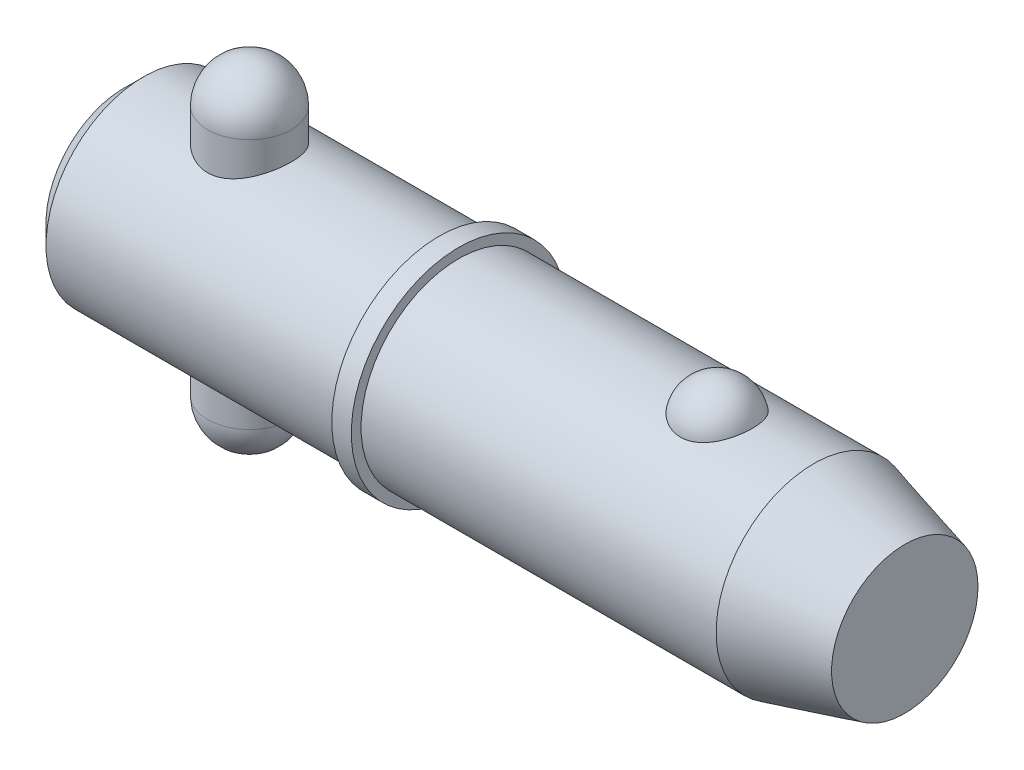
ISO-10303-21;
HEADER;
FILE_DESCRIPTION(('STEP AP214'),'2;1');
FILE_NAME('part.step','',(''),(''),'','','');
FILE_SCHEMA(('AUTOMOTIVE_DESIGN { 1 0 10303 214 1 1 1 1 }'));
ENDSEC;
DATA;
#1=APPLICATION_CONTEXT('core data for automotive mechanical design processes');
#2=APPLICATION_PROTOCOL_DEFINITION('international standard','automotive_design',2000,#1);
#3=PRODUCT_CONTEXT('',#1,'mechanical');
#4=PRODUCT('Part','Part','',(#3));
#5=PRODUCT_RELATED_PRODUCT_CATEGORY('part','',(#4));
#6=PRODUCT_DEFINITION_FORMATION('','',#4);
#7=PRODUCT_DEFINITION_CONTEXT('part definition',#1,'design');
#8=PRODUCT_DEFINITION('design','',#6,#7);
#9=PRODUCT_DEFINITION_SHAPE('','',#8);
#10=(LENGTH_UNIT() NAMED_UNIT(*) SI_UNIT(.MILLI.,.METRE.));
#11=(NAMED_UNIT(*) PLANE_ANGLE_UNIT() SI_UNIT($,.RADIAN.));
#12=(NAMED_UNIT(*) SI_UNIT($,.STERADIAN.) SOLID_ANGLE_UNIT());
#13=UNCERTAINTY_MEASURE_WITH_UNIT(LENGTH_MEASURE(1.E-05),#10,'distance_accuracy_value','');
#14=(GEOMETRIC_REPRESENTATION_CONTEXT(3) GLOBAL_UNCERTAINTY_ASSIGNED_CONTEXT((#13)) GLOBAL_UNIT_ASSIGNED_CONTEXT((#10,
#11,#12)) REPRESENTATION_CONTEXT('',''));
#15=CARTESIAN_POINT('',(0.,0.,0.));
#16=DIRECTION('',(0.,0.,1.));
#17=DIRECTION('',(1.,0.,0.));
#18=AXIS2_PLACEMENT_3D('',#15,#16,#17);
#19=CARTESIAN_POINT('',(14.28,19.05,0.));
#20=DIRECTION('',(0.,-1.,0.));
#21=DIRECTION('',(0.,0.,-1.));
#22=AXIS2_PLACEMENT_3D('',#19,#20,#21);
#23=CYLINDRICAL_SURFACE('',#22,4.76);
#24=CARTESIAN_POINT('',(14.28,-14.29,0.));
#25=DIRECTION('',(0.,-1.,0.));
#26=DIRECTION('',(0.,0.,-1.));
#27=AXIS2_PLACEMENT_3D('',#24,#25,#26);
#28=CIRCLE('',#27,4.76);
#29=CARTESIAN_POINT('',(14.28,-14.29,-4.76));
#30=VERTEX_POINT('',#29);
#31=EDGE_CURVE('P0_E10',#30,#30,#28,.F.);
#32=CARTESIAN_POINT('',(14.28,14.29,0.));
#33=DIRECTION('',(0.,-1.,0.));
#34=DIRECTION('',(0.,0.,-1.));
#35=AXIS2_PLACEMENT_3D('',#32,#33,#34);
#36=CIRCLE('',#35,4.76);
#37=CARTESIAN_POINT('',(14.28,14.29,-4.76));
#38=VERTEX_POINT('',#37);
#39=EDGE_CURVE('P0_E21',#38,#38,#36,.T.);
#40=CARTESIAN_POINT('',(14.28,-14.29,-4.76));
#41=CARTESIAN_POINT('',(14.28,-13.9922916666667,-4.76));
#42=CARTESIAN_POINT('',(14.28,-13.6945833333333,-4.76));
#43=CARTESIAN_POINT('',(14.28,-13.0991666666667,-4.76));
#44=CARTESIAN_POINT('',(14.28,-12.8014583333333,-4.76));
#45=CARTESIAN_POINT('',(14.28,-12.2060416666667,-4.76));
#46=CARTESIAN_POINT('',(14.28,-11.9083333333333,-4.76));
#47=CARTESIAN_POINT('',(14.28,-11.3129166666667,-4.76));
#48=CARTESIAN_POINT('',(14.28,-11.0152083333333,-4.76));
#49=CARTESIAN_POINT('',(14.28,-10.4197916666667,-4.76));
#50=CARTESIAN_POINT('',(14.28,-10.1220833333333,-4.76));
#51=CARTESIAN_POINT('',(14.28,-9.52666666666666,-4.76));
#52=CARTESIAN_POINT('',(14.28,-9.22895833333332,-4.76));
#53=CARTESIAN_POINT('',(14.28,-8.63354166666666,-4.76));
#54=CARTESIAN_POINT('',(14.28,-8.33583333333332,-4.76));
#55=CARTESIAN_POINT('',(14.28,-7.74041666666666,-4.76));
#56=CARTESIAN_POINT('',(14.28,-7.44270833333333,-4.76));
#57=CARTESIAN_POINT('',(14.28,-6.84729166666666,-4.76));
#58=CARTESIAN_POINT('',(14.28,-6.54958333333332,-4.76));
#59=CARTESIAN_POINT('',(14.28,-5.95416666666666,-4.76));
#60=CARTESIAN_POINT('',(14.28,-5.65645833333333,-4.76));
#61=CARTESIAN_POINT('',(14.28,-5.06104166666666,-4.76));
#62=CARTESIAN_POINT('',(14.28,-4.76333333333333,-4.76));
#63=CARTESIAN_POINT('',(14.28,-4.16791666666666,-4.76));
#64=CARTESIAN_POINT('',(14.28,-3.87020833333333,-4.76));
#65=CARTESIAN_POINT('',(14.28,-3.27479166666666,-4.76));
#66=CARTESIAN_POINT('',(14.28,-2.97708333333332,-4.76));
#67=CARTESIAN_POINT('',(14.28,-2.38166666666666,-4.76));
#68=CARTESIAN_POINT('',(14.28,-2.08395833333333,-4.76));
#69=CARTESIAN_POINT('',(14.28,-1.48854166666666,-4.76));
#70=CARTESIAN_POINT('',(14.28,-1.19083333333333,-4.76));
#71=CARTESIAN_POINT('',(14.28,-0.595416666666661,-4.76));
#72=CARTESIAN_POINT('',(14.28,-0.297708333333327,-4.76));
#73=CARTESIAN_POINT('',(14.28,0.297708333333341,-4.76));
#74=CARTESIAN_POINT('',(14.28,0.595416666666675,-4.76));
#75=CARTESIAN_POINT('',(14.28,1.19083333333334,-4.76));
#76=CARTESIAN_POINT('',(14.28,1.48854166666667,-4.76));
#77=CARTESIAN_POINT('',(14.28,2.08395833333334,-4.76));
#78=CARTESIAN_POINT('',(14.28,2.38166666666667,-4.76));
#79=CARTESIAN_POINT('',(14.28,2.97708333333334,-4.76));
#80=CARTESIAN_POINT('',(14.28,3.27479166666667,-4.76));
#81=CARTESIAN_POINT('',(14.28,3.87020833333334,-4.76));
#82=CARTESIAN_POINT('',(14.28,4.16791666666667,-4.76));
#83=CARTESIAN_POINT('',(14.28,4.76333333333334,-4.76));
#84=CARTESIAN_POINT('',(14.28,5.06104166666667,-4.76));
#85=CARTESIAN_POINT('',(14.28,5.65645833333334,-4.76));
#86=CARTESIAN_POINT('',(14.28,5.95416666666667,-4.76));
#87=CARTESIAN_POINT('',(14.28,6.54958333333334,-4.76));
#88=CARTESIAN_POINT('',(14.28,6.84729166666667,-4.76));
#89=CARTESIAN_POINT('',(14.28,7.44270833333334,-4.76));
#90=CARTESIAN_POINT('',(14.28,7.74041666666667,-4.76));
#91=CARTESIAN_POINT('',(14.28,8.33583333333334,-4.76));
#92=CARTESIAN_POINT('',(14.28,8.63354166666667,-4.76));
#93=CARTESIAN_POINT('',(14.28,9.22895833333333,-4.76));
#94=CARTESIAN_POINT('',(14.28,9.52666666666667,-4.76));
#95=CARTESIAN_POINT('',(14.28,10.1220833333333,-4.76));
#96=CARTESIAN_POINT('',(14.28,10.4197916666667,-4.76));
#97=CARTESIAN_POINT('',(14.28,11.0152083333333,-4.76));
#98=CARTESIAN_POINT('',(14.28,11.3129166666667,-4.76));
#99=CARTESIAN_POINT('',(14.28,11.9083333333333,-4.76));
#100=CARTESIAN_POINT('',(14.28,12.2060416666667,-4.76));
#101=CARTESIAN_POINT('',(14.28,12.8014583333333,-4.76));
#102=CARTESIAN_POINT('',(14.28,13.0991666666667,-4.76));
#103=CARTESIAN_POINT('',(14.28,13.6945833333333,-4.76));
#104=CARTESIAN_POINT('',(14.28,13.9922916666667,-4.76));
#105=CARTESIAN_POINT('',(14.28,14.29,-4.76));
#106=B_SPLINE_CURVE_WITH_KNOTS('',3,(#40,#41,#42,#43,#44,#45,#46,#47,#48,#49,#50,#51,#52,#53,
#54,#55,#56,#57,#58,#59,#60,#61,#62,#63,#64,#65,#66,#67,#68,#69,#70,#71,#72,#73,#74,#75,#76,#77,
#78,#79,#80,#81,#82,#83,#84,#85,#86,#87,#88,#89,#90,#91,#92,#93,#94,#95,#96,#97,#98,#99,#100,
#101,#102,#103,#104,#105),.UNSPECIFIED.,.F.,.F.,(4,2,2,2,2,2,2,2,2,2,2,2,2,2,2,2,2,2,2,2,2,2,2,
2,2,2,2,2,2,2,2,2,4),(0.,0.893125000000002,1.78625,2.67937499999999,3.5725,4.465625,5.35875,
6.25187499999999,7.145,8.038125,8.93125,9.82437499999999,10.7175,11.610625,12.50375,13.396875,
14.29,15.183125,16.07625,16.969375,17.8625,18.755625,19.64875,20.541875,21.435,22.328125,
23.22125,24.114375,25.0075,25.900625,26.79375,27.686875,28.58),.UNSPECIFIED.);
#107=EDGE_CURVE('P0_BSEAM14',#30,#38,#106,.T.);
#108=ORIENTED_EDGE('',*,*,#31,.T.);
#109=ORIENTED_EDGE('',*,*,#39,.T.);
#110=ORIENTED_EDGE('',*,*,#107,.T.);
#111=ORIENTED_EDGE('',*,*,#107,.F.);
#112=EDGE_LOOP('',(#108,#110,#109,#111));
#113=FACE_BOUND('',#112,.T.);
#114=ADVANCED_FACE('P0_F14',(#113),#23,.T.);
#115=CARTESIAN_POINT('',(14.28,-14.29,0.));
#116=DIRECTION('',(0.,0.,1.));
#117=DIRECTION('',(1.,0.,0.));
#118=AXIS2_PLACEMENT_3D('',#115,#116,#117);
#119=SPHERICAL_SURFACE('',#118,4.76);
#120=CARTESIAN_POINT('',(14.28,-14.29,0.));
#121=DIRECTION('',(0.,-1.,0.));
#122=DIRECTION('',(0.,0.,-1.));
#123=AXIS2_PLACEMENT_3D('',#120,#121,#122);
#124=SPHERICAL_SURFACE('',#123,4.76);
#125=ORIENTED_EDGE('',*,*,#31,.F.);
#126=EDGE_LOOP('',(#125));
#127=FACE_BOUND('',#126,.T.);
#128=ADVANCED_FACE('P0_F29',(#127),#124,.T.);
#129=CARTESIAN_POINT('',(14.28,14.29,0.));
#130=DIRECTION('',(0.,0.,1.));
#131=DIRECTION('',(1.,0.,0.));
#132=AXIS2_PLACEMENT_3D('',#129,#130,#131);
#133=SPHERICAL_SURFACE('',#132,4.76);
#134=CARTESIAN_POINT('',(14.28,14.29,0.));
#135=DIRECTION('',(0.,-1.,0.));
#136=DIRECTION('',(0.,0.,-1.));
#137=AXIS2_PLACEMENT_3D('',#134,#135,#136);
#138=SPHERICAL_SURFACE('',#137,4.76);
#139=ORIENTED_EDGE('',*,*,#39,.F.);
#140=EDGE_LOOP('',(#139));
#141=FACE_BOUND('',#140,.T.);
#142=ADVANCED_FACE('P0_F16',(#141),#138,.T.);
#143=CLOSED_SHELL('',(#114,#128,#142));
#144=MANIFOLD_SOLID_BREP('P0_B1',#143);
#145=CARTESIAN_POINT('',(0.,0.,0.));
#146=DIRECTION('',(1.,0.,0.));
#147=DIRECTION('',(0.,0.,-1.));
#148=AXIS2_PLACEMENT_3D('',#145,#146,#147);
#149=CYLINDRICAL_SURFACE('',#148,11.115);
#150=CARTESIAN_POINT('',(78.529563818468,0.,0.));
#151=DIRECTION('',(1.,0.,0.));
#152=DIRECTION('',(0.,0.,-1.));
#153=AXIS2_PLACEMENT_3D('',#150,#151,#152);
#154=CIRCLE('',#153,11.115);
#155=CARTESIAN_POINT('',(78.529563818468,0.,-11.115));
#156=VERTEX_POINT('',#155);
#157=EDGE_CURVE('P1_E81',#156,#156,#154,.T.);
#158=ORIENTED_EDGE('',*,*,#157,.F.);
#159=EDGE_LOOP('',(#158));
#160=FACE_BOUND('',#159,.T.);
#161=CARTESIAN_POINT('',(38.1,0.,0.));
#162=DIRECTION('',(1.,0.,0.));
#163=DIRECTION('',(0.,0.,-1.));
#164=AXIS2_PLACEMENT_3D('',#161,#162,#163);
#165=CIRCLE('',#164,11.115);
#166=CARTESIAN_POINT('',(38.1,0.,-11.115));
#167=VERTEX_POINT('',#166);
#168=EDGE_CURVE('P1_E85',#167,#167,#165,.T.);
#169=ORIENTED_EDGE('',*,*,#168,.T.);
#170=EDGE_LOOP('',(#169));
#171=FACE_BOUND('',#170,.T.);
#172=CARTESIAN_POINT('',(67.5310680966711,10.3028087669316,4.17077409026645));
#173=CARTESIAN_POINT('',(67.3147756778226,10.3028003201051,4.17078240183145));
#174=CARTESIAN_POINT('',(67.0985488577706,10.3098895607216,4.15340593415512));
#175=CARTESIAN_POINT('',(66.6725408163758,10.3373834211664,4.08449540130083));
#176=CARTESIAN_POINT('',(66.4627577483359,10.3577841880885,4.03297121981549));
#177=CARTESIAN_POINT('',(66.0557825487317,10.4095237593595,3.89746513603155));
#178=CARTESIAN_POINT('',(65.8585726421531,10.4408466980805,3.81353029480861));
#179=CARTESIAN_POINT('',(65.4813382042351,10.5110236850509,3.61560339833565));
#180=CARTESIAN_POINT('',(65.3013171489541,10.5498792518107,3.50160528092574));
#181=CARTESIAN_POINT('',(64.9576842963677,10.6322884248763,3.24292464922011));
#182=CARTESIAN_POINT('',(64.7946861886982,10.6759443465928,3.09746040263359));
#183=CARTESIAN_POINT('',(64.4945911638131,10.7625291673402,2.78171925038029));
#184=CARTESIAN_POINT('',(64.3574990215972,10.8054579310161,2.61143778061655));
#185=CARTESIAN_POINT('',(64.1064084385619,10.8881935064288,2.24226695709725));
#186=CARTESIAN_POINT('',(63.9937105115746,10.9277761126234,2.04244123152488));
#187=CARTESIAN_POINT('',(63.8017771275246,10.997484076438,1.62578254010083));
#188=CARTESIAN_POINT('',(63.722544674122,11.0276085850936,1.40894804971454));
#189=CARTESIAN_POINT('',(63.5983034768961,11.0756732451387,0.961250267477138));
#190=CARTESIAN_POINT('',(63.553760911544,11.0934470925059,0.730239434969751));
#191=CARTESIAN_POINT('',(63.5015695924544,11.1143331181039,0.263439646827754));
#192=CARTESIAN_POINT('',(63.4939200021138,11.1174456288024,0.0276507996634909));
#193=CARTESIAN_POINT('',(63.5156105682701,11.1087161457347,-0.440729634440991));
#194=CARTESIAN_POINT('',(63.5447624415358,11.0969502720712,-0.673331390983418));
#195=CARTESIAN_POINT('',(63.6391432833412,11.0597872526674,-1.12996621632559));
#196=CARTESIAN_POINT('',(63.7043729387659,11.0343898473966,-1.35399912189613));
#197=CARTESIAN_POINT('',(63.8696984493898,10.972515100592,-1.78750286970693));
#198=CARTESIAN_POINT('',(63.9698386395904,10.9360236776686,-1.99695478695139));
#199=CARTESIAN_POINT('',(64.2029408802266,10.8557595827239,-2.3952066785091));
#200=CARTESIAN_POINT('',(64.3359054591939,10.8119863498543,-2.5840050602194));
#201=CARTESIAN_POINT('',(64.632407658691,10.7216733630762,-2.93635726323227));
#202=CARTESIAN_POINT('',(64.7960565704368,10.675123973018,-3.09981510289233));
#203=CARTESIAN_POINT('',(65.1498601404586,10.5846571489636,-3.39592247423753));
#204=CARTESIAN_POINT('',(65.3400123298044,10.5407394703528,-3.52857487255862));
#205=CARTESIAN_POINT('',(65.7375014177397,10.4616690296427,-3.75646057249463));
#206=CARTESIAN_POINT('',(65.9443670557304,10.4263443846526,-3.85245432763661));
#207=CARTESIAN_POINT('',(66.3729541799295,10.3675574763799,-4.00798747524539));
#208=CARTESIAN_POINT('',(66.594670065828,10.3440907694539,-4.0675405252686));
#209=CARTESIAN_POINT('',(67.0346695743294,10.3128282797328,-4.14614314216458));
#210=CARTESIAN_POINT('',(67.2525654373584,10.3043040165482,-4.1670783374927));
#211=CARTESIAN_POINT('',(67.68894951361,10.3016771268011,-4.17357158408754));
#212=CARTESIAN_POINT('',(67.9074376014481,10.3075716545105,-4.15913661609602));
#213=CARTESIAN_POINT('',(68.3317442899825,10.3326686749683,-4.09636961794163));
#214=CARTESIAN_POINT('',(68.5377458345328,10.3514555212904,-4.0490957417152));
#215=CARTESIAN_POINT('',(68.9385764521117,10.399818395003,-3.92320197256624));
#216=CARTESIAN_POINT('',(69.1334046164,10.4293952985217,-3.84457953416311));
#217=CARTESIAN_POINT('',(69.5111917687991,10.4969600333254,-3.65612410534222));
#218=CARTESIAN_POINT('',(69.6937974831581,10.5351178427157,-3.54564545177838));
#219=CARTESIAN_POINT('',(70.0382040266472,10.6154999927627,-3.29718036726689));
#220=CARTESIAN_POINT('',(70.200000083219,10.657725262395,-3.15918764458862));
#221=CARTESIAN_POINT('',(70.5069596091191,10.744212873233,-2.85163580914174));
#222=CARTESIAN_POINT('',(70.6508919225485,10.7884718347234,-2.68084605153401));
#223=CARTESIAN_POINT('',(70.9092371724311,10.872374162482,-2.31721864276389));
#224=CARTESIAN_POINT('',(71.0236448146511,10.9120167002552,-2.12437704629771));
#225=CARTESIAN_POINT('',(71.2238739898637,10.9838919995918,-1.71516999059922));
#226=CARTESIAN_POINT('',(71.3086617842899,11.0158465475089,-1.498248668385));
#227=CARTESIAN_POINT('',(71.4426838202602,11.0673523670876,-1.052285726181));
#228=CARTESIAN_POINT('',(71.4919174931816,11.086903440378,-0.823243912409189));
#229=CARTESIAN_POINT('',(71.5538915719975,11.1116323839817,-0.359087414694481));
#230=CARTESIAN_POINT('',(71.5665662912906,11.1167843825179,-0.123962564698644));
#231=CARTESIAN_POINT('',(71.554973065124,11.1121144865,0.345220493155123));
#232=CARTESIAN_POINT('',(71.5307056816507,11.1022928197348,0.579278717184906));
#233=CARTESIAN_POINT('',(71.4459073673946,11.0687504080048,1.03866534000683));
#234=CARTESIAN_POINT('',(71.3855299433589,11.0450885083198,1.26402641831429));
#235=CARTESIAN_POINT('',(71.2298532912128,10.9863185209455,1.70076772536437));
#236=CARTESIAN_POINT('',(71.134551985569,10.9512097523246,1.91214712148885));
#237=CARTESIAN_POINT('',(70.9103974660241,10.8729733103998,2.31608359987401));
#238=CARTESIAN_POINT('',(70.7813806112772,10.8298068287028,2.50854240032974));
#239=CARTESIAN_POINT('',(70.4927327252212,10.7401896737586,2.86808766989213));
#240=CARTESIAN_POINT('',(70.3331022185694,10.6937390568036,3.03517457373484));
#241=CARTESIAN_POINT('',(69.9875341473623,10.6029321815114,3.33857581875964));
#242=CARTESIAN_POINT('',(69.8017089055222,10.5585680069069,3.47501541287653));
#243=CARTESIAN_POINT('',(69.4078750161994,10.4769321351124,3.71390897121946));
#244=CARTESIAN_POINT('',(69.1998635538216,10.439661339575,3.81635861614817));
#245=CARTESIAN_POINT('',(68.7540666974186,10.3749407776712,3.98910631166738));
#246=CARTESIAN_POINT('',(68.5152342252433,10.3482457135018,4.05700929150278));
#247=CARTESIAN_POINT('',(68.0279254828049,10.312188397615,4.14782844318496));
#248=CARTESIAN_POINT('',(67.7794535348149,10.3028184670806,4.17076454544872));
#249=CARTESIAN_POINT('',(67.5310680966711,10.3028087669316,4.17077409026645));
#250=B_SPLINE_CURVE_WITH_KNOTS('',3,(#172,#173,#174,#175,#176,#177,#178,#179,#180,#181,#182,
#183,#184,#185,#186,#187,#188,#189,#190,#191,#192,#193,#194,#195,#196,#197,#198,#199,#200,#201,
#202,#203,#204,#205,#206,#207,#208,#209,#210,#211,#212,#213,#214,#215,#216,#217,#218,#219,#220,
#221,#222,#223,#224,#225,#226,#227,#228,#229,#230,#231,#232,#233,#234,#235,#236,#237,#238,#239,
#240,#241,#242,#243,#244,#245,#246,#247,#248,#249),.UNSPECIFIED.,.T.,.F.,(4,2,2,2,2,2,2,2,2,2,2,
2,2,2,2,2,2,2,2,2,2,2,2,2,2,2,2,2,2,2,2,2,2,2,2,2,2,2,4),(0.,0.647966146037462,1.29574482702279,
1.94258643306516,2.58955857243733,3.25496465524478,3.92049326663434,4.61566368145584,
5.31089647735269,6.01531821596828,6.71972398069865,7.42054043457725,8.12137023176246,
8.82309331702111,9.52487047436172,10.2292439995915,10.9335519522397,11.6223330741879,
12.3108558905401,12.9647664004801,13.6185478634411,14.2521847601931,14.8858731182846,
15.5334360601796,16.1811472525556,16.8611459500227,17.5412664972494,18.2431855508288,
18.9451158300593,19.6483065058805,20.3514864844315,21.0516982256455,21.7519516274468,
22.4556690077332,23.1593743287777,23.8601491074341,24.5610129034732,25.3054529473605,
26.049562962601),.UNSPECIFIED.);
#251=CARTESIAN_POINT('',(67.5310680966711,10.3028087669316,4.17077409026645));
#252=VERTEX_POINT('',#251);
#253=EDGE_CURVE('P1_E35',#252,#252,#250,.T.);
#254=ORIENTED_EDGE('',*,*,#253,.T.);
#255=EDGE_LOOP('',(#254));
#256=FACE_BOUND('',#255,.T.);
#257=ADVANCED_FACE('P1_F13',(#160,#171,#256),#149,.T.);
#258=CARTESIAN_POINT('',(0.,0.,0.));
#259=DIRECTION('',(-1.,0.,0.));
#260=DIRECTION('',(0.,0.,1.));
#261=AXIS2_PLACEMENT_3D('',#258,#259,#260);
#262=PLANE('',#261);
#263=CARTESIAN_POINT('',(0.,0.,0.));
#264=DIRECTION('',(1.,0.,0.));
#265=DIRECTION('',(0.,0.,-1.));
#266=AXIS2_PLACEMENT_3D('',#263,#264,#265);
#267=CIRCLE('',#266,8.892);
#268=CARTESIAN_POINT('',(0.,0.,-8.892));
#269=VERTEX_POINT('',#268);
#270=EDGE_CURVE('P1_E9',#269,#269,#267,.T.);
#271=ORIENTED_EDGE('',*,*,#270,.F.);
#272=EDGE_LOOP('',(#271));
#273=FACE_BOUND('',#272,.T.);
#274=ADVANCED_FACE('P1_F15',(#273),#262,.T.);
#275=CARTESIAN_POINT('',(2.22299999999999,0.,0.));
#276=DIRECTION('',(1.,0.,0.));
#277=DIRECTION('',(0.,0.,-1.));
#278=AXIS2_PLACEMENT_3D('',#275,#276,#277);
#279=CONICAL_SURFACE('',#278,11.115,0.78539816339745);
#280=ORIENTED_EDGE('',*,*,#270,.T.);
#281=EDGE_LOOP('',(#280));
#282=FACE_BOUND('',#281,.T.);
#283=CARTESIAN_POINT('',(2.22299999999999,0.,0.));
#284=DIRECTION('',(1.,0.,0.));
#285=DIRECTION('',(0.,0.,-1.));
#286=AXIS2_PLACEMENT_3D('',#283,#284,#285);
#287=CIRCLE('',#286,11.115);
#288=CARTESIAN_POINT('',(2.22299999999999,0.,-11.115));
#289=VERTEX_POINT('',#288);
#290=EDGE_CURVE('P1_E26',#289,#289,#287,.T.);
#291=ORIENTED_EDGE('',*,*,#290,.F.);
#292=EDGE_LOOP('',(#291));
#293=FACE_BOUND('',#292,.T.);
#294=ADVANCED_FACE('P1_F77',(#282,#293),#279,.T.);
#295=CARTESIAN_POINT('',(0.,0.,0.));
#296=DIRECTION('',(1.,0.,0.));
#297=DIRECTION('',(0.,0.,-1.));
#298=AXIS2_PLACEMENT_3D('',#295,#296,#297);
#299=CYLINDRICAL_SURFACE('',#298,11.115);
#300=CARTESIAN_POINT('',(14.28,-10.0441836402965,4.76));
#301=CARTESIAN_POINT('',(14.1533731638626,-10.0441846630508,4.75999904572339));
#302=CARTESIAN_POINT('',(14.0267055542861,-10.0465865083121,4.75493985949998));
#303=CARTESIAN_POINT('',(13.774298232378,-10.0561141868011,4.73475585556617));
#304=CARTESIAN_POINT('',(13.6485591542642,-10.0632429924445,4.71962470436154));
#305=CARTESIAN_POINT('',(13.3987500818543,-10.0819979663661,4.67942666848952));
#306=CARTESIAN_POINT('',(13.2746840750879,-10.0936334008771,4.65433930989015));
#307=CARTESIAN_POINT('',(13.0293244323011,-10.1210146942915,4.59449317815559));
#308=CARTESIAN_POINT('',(12.9080319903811,-10.1367622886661,4.55973032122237));
#309=CARTESIAN_POINT('',(12.669614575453,-10.1717810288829,4.48106435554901));
#310=CARTESIAN_POINT('',(12.5524727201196,-10.1910352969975,4.4372048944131));
#311=CARTESIAN_POINT('',(12.3224300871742,-10.2325403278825,4.34063417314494));
#312=CARTESIAN_POINT('',(12.2095309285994,-10.2547922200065,4.28791957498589));
#313=CARTESIAN_POINT('',(11.8782785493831,-10.3250879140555,4.11715127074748));
#314=CARTESIAN_POINT('',(11.6670799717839,-10.3767168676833,3.98637638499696));
#315=CARTESIAN_POINT('',(11.2564039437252,-10.4874309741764,3.68567149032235));
#316=CARTESIAN_POINT('',(11.0583793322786,-10.5467772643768,3.51386978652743));
#317=CARTESIAN_POINT('',(10.6927724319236,-10.6641377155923,3.13969960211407));
#318=CARTESIAN_POINT('',(10.5252022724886,-10.7221513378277,2.93731900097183));
#319=CARTESIAN_POINT('',(10.2965609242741,-10.8050020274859,2.60935726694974));
#320=CARTESIAN_POINT('',(10.2227768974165,-10.8324811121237,2.49310321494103));
#321=CARTESIAN_POINT('',(10.0853380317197,-10.884703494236,2.25418999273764));
#322=CARTESIAN_POINT('',(10.0216789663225,-10.9094479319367,2.13153352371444));
#323=CARTESIAN_POINT('',(9.90506238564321,-10.9554932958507,1.88060370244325));
#324=CARTESIAN_POINT('',(9.85210574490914,-10.9767939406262,1.7523298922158));
#325=CARTESIAN_POINT('',(9.75746464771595,-11.0153112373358,1.49115740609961));
#326=CARTESIAN_POINT('',(9.71577447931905,-11.0325299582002,1.35826111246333));
#327=CARTESIAN_POINT('',(9.64605475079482,-11.0615607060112,1.09614539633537));
#328=CARTESIAN_POINT('',(9.61740732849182,-11.0736151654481,0.96711700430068));
#329=CARTESIAN_POINT('',(9.57092026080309,-11.0932687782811,0.706847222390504));
#330=CARTESIAN_POINT('',(9.55307574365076,-11.1008699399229,0.575606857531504));
#331=CARTESIAN_POINT('',(9.52838640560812,-11.1114054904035,0.31192917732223));
#332=CARTESIAN_POINT('',(9.52153986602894,-11.114340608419,0.179492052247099));
#333=CARTESIAN_POINT('',(9.51892405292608,-11.1154607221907,-0.0855090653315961));
#334=CARTESIAN_POINT('',(9.52315432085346,-11.1136459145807,-0.218073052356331));
#335=CARTESIAN_POINT('',(9.542009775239,-11.1055891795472,-0.473709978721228));
#336=CARTESIAN_POINT('',(9.55594693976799,-11.099640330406,-0.596843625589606));
#337=CARTESIAN_POINT('',(9.59332832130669,-11.0837823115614,-0.841440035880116));
#338=CARTESIAN_POINT('',(9.61677567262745,-11.0738718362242,-0.962902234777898));
#339=CARTESIAN_POINT('',(9.67294089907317,-11.0503378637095,-1.20325684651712));
#340=CARTESIAN_POINT('',(9.70565569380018,-11.0367156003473,-1.32215009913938));
#341=CARTESIAN_POINT('',(9.78005008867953,-11.0060908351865,-1.55666640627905));
#342=CARTESIAN_POINT('',(9.82173311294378,-10.9890870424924,-1.67228819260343));
#343=CARTESIAN_POINT('',(9.96110379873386,-10.9330280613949,-2.01656166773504));
#344=CARTESIAN_POINT('',(10.0722987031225,-10.8892801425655,-2.23915547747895));
#345=CARTESIAN_POINT('',(10.3268588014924,-10.7934745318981,-2.66299199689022));
#346=CARTESIAN_POINT('',(10.4702355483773,-10.7414138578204,-2.86422700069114));
#347=CARTESIAN_POINT('',(10.7973904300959,-10.6296201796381,-3.25557775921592));
#348=CARTESIAN_POINT('',(10.9833705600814,-10.569604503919,-3.443774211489));
#349=CARTESIAN_POINT('',(11.3844486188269,-10.4514707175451,-3.78722133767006));
#350=CARTESIAN_POINT('',(11.5995590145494,-10.3933534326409,-3.94245783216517));
#351=CARTESIAN_POINT('',(11.9444340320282,-10.311516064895,-4.14990014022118));
#352=CARTESIAN_POINT('',(12.0654579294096,-10.2847012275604,-4.21573894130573));
#353=CARTESIAN_POINT('',(12.3132718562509,-10.2342051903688,-4.33688518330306));
#354=CARTESIAN_POINT('',(12.4400593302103,-10.2105226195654,-4.39219723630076));
#355=CARTESIAN_POINT('',(12.6985418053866,-10.1671237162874,-4.49174500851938));
#356=CARTESIAN_POINT('',(12.8302359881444,-10.1474067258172,-4.53598256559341));
#357=CARTESIAN_POINT('',(13.0975061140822,-10.1126841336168,-4.61287629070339));
#358=CARTESIAN_POINT('',(13.233079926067,-10.0976759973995,-4.64553869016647));
#359=CARTESIAN_POINT('',(13.4978553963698,-10.0737863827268,-4.6971059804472));
#360=CARTESIAN_POINT('',(13.6268754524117,-10.0645618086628,-4.716785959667));
#361=CARTESIAN_POINT('',(13.8862990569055,-10.051062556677,-4.74548419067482));
#362=CARTESIAN_POINT('',(14.0167019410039,-10.0467856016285,-4.75450734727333));
#363=CARTESIAN_POINT('',(14.277859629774,-10.0433352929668,-4.76179143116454));
#364=CARTESIAN_POINT('',(14.4086143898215,-10.0441613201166,-4.76005366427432));
#365=CARTESIAN_POINT('',(14.6694025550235,-10.0508838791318,-4.74584231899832));
#366=CARTESIAN_POINT('',(14.7994359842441,-10.0567802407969,-4.73336910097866));
#367=CARTESIAN_POINT('',(15.0487369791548,-10.0728449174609,-4.69907984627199));
#368=CARTESIAN_POINT('',(15.1681238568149,-10.0826872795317,-4.67797462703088));
#369=CARTESIAN_POINT('',(15.4045894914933,-10.1062580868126,-4.62682977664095));
#370=CARTESIAN_POINT('',(15.5216674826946,-10.1199877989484,-4.59678723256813));
#371=CARTESIAN_POINT('',(15.868278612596,-10.1664161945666,-4.49365911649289));
#372=CARTESIAN_POINT('',(16.0933756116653,-10.2043671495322,-4.40754694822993));
#373=CARTESIAN_POINT('',(16.5357981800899,-10.2919879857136,-4.19898201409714));
#374=CARTESIAN_POINT('',(16.7523611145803,-10.3420954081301,-4.07511281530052));
#375=CARTESIAN_POINT('',(17.1627188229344,-10.4477911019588,-3.7959429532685));
#376=CARTESIAN_POINT('',(17.3565033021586,-10.5033818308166,-3.64062816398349));
#377=CARTESIAN_POINT('',(17.7334034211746,-10.6196376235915,-3.28693729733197));
#378=CARTESIAN_POINT('',(17.9141276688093,-10.6803237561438,-3.08599175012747));
#379=CARTESIAN_POINT('',(18.1582189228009,-10.7666348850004,-2.76320365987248));
#380=CARTESIAN_POINT('',(18.2351223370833,-10.7946346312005,-2.65197124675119));
#381=CARTESIAN_POINT('',(18.3793967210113,-10.8483267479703,-2.42297927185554));
#382=CARTESIAN_POINT('',(18.4467718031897,-10.87402011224,-2.30522255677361));
#383=CARTESIAN_POINT('',(18.5717669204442,-10.9225249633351,-2.06324665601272));
#384=CARTESIAN_POINT('',(18.6293326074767,-10.9453202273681,-1.93899615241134));
#385=CARTESIAN_POINT('',(18.73370006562,-10.9872100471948,-1.6855059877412));
#386=CARTESIAN_POINT('',(18.7805065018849,-11.0063062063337,-1.55626851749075));
#387=CARTESIAN_POINT('',(18.8628731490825,-11.0402419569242,-1.29375150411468));
#388=CARTESIAN_POINT('',(18.8984366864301,-11.0550828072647,-1.16047316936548));
#389=CARTESIAN_POINT('',(18.9579183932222,-11.0800638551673,-0.890912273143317));
#390=CARTESIAN_POINT('',(18.9818374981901,-11.0902044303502,-0.75462995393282));
#391=CARTESIAN_POINT('',(19.0164177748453,-11.104911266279,-0.490295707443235));
#392=CARTESIAN_POINT('',(19.027922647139,-11.1098318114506,-0.362373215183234));
#393=CARTESIAN_POINT('',(19.040554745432,-11.1152360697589,-0.105876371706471));
#394=CARTESIAN_POINT('',(19.0416784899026,-11.1157182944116,0.0226981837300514));
#395=CARTESIAN_POINT('',(19.0335275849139,-11.1122291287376,0.27938352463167));
#396=CARTESIAN_POINT('',(19.0242587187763,-11.1082602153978,0.407494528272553));
#397=CARTESIAN_POINT('',(18.9954320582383,-11.0959792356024,0.662388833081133));
#398=CARTESIAN_POINT('',(18.9758704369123,-11.0876655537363,0.789171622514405));
#399=CARTESIAN_POINT('',(18.9276379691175,-11.0673259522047,1.03545890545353));
#400=CARTESIAN_POINT('',(18.8993573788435,-11.0554596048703,1.15505309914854));
#401=CARTESIAN_POINT('',(18.8337694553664,-11.0282166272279,1.39134516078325));
#402=CARTESIAN_POINT('',(18.7964589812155,-11.0128387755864,1.5080420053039));
#403=CARTESIAN_POINT('',(18.671464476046,-10.9619666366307,1.85262797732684));
#404=CARTESIAN_POINT('',(18.5706772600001,-10.9217161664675,2.07521484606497));
#405=CARTESIAN_POINT('',(18.33202463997,-10.8301378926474,2.51061719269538));
#406=CARTESIAN_POINT('',(18.1926775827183,-10.7783885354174,2.72252375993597));
#407=CARTESIAN_POINT('',(17.8829747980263,-10.669863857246,3.12088015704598));
#408=CARTESIAN_POINT('',(17.7126068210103,-10.6130865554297,3.30731987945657));
#409=CARTESIAN_POINT('',(17.3310036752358,-10.495668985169,3.66358491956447));
#410=CARTESIAN_POINT('',(17.1177010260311,-10.4350471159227,3.83122543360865));
#411=CARTESIAN_POINT('',(16.7778915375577,-10.3495418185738,4.05420569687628));
#412=CARTESIAN_POINT('',(16.6612023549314,-10.3219229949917,4.12383380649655));
#413=CARTESIAN_POINT('',(16.4218466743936,-10.2693487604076,4.25306463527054));
#414=CARTESIAN_POINT('',(16.2991829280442,-10.2443921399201,4.31267191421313));
#415=CARTESIAN_POINT('',(16.0488008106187,-10.1979981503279,4.42126071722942));
#416=CARTESIAN_POINT('',(15.9210894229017,-10.1765561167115,4.47025635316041));
#417=CARTESIAN_POINT('',(15.6613937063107,-10.1379191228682,4.55720152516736));
#418=CARTESIAN_POINT('',(15.5294115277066,-10.1207220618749,4.59515652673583));
#419=CARTESIAN_POINT('',(15.2624981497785,-10.091252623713,4.65951684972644));
#420=CARTESIAN_POINT('',(15.1275757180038,-10.0789672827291,4.68595259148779));
#421=CARTESIAN_POINT('',(14.8556442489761,-10.0597530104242,4.72706206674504));
#422=CARTESIAN_POINT('',(14.7186368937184,-10.0528199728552,4.74174481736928));
#423=CARTESIAN_POINT('',(14.5310955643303,-10.047196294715,4.75363843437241));
#424=CARTESIAN_POINT('',(14.48091543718,-10.0460674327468,4.75602323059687));
#425=CARTESIAN_POINT('',(14.3804923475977,-10.044560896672,4.7592042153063));
#426=CARTESIAN_POINT('',(14.3302493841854,-10.0441832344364,4.76000037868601));
#427=CARTESIAN_POINT('',(14.28,-10.0441836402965,4.76));
#428=B_SPLINE_CURVE_WITH_KNOTS('',3,(#300,#301,#302,#303,#304,#305,#306,#307,#308,#309,#310,
#311,#312,#313,#314,#315,#316,#317,#318,#319,#320,#321,#322,#323,#324,#325,#326,#327,#328,#329,
#330,#331,#332,#333,#334,#335,#336,#337,#338,#339,#340,#341,#342,#343,#344,#345,#346,#347,#348,
#349,#350,#351,#352,#353,#354,#355,#356,#357,#358,#359,#360,#361,#362,#363,#364,#365,#366,#367,
#368,#369,#370,#371,#372,#373,#374,#375,#376,#377,#378,#379,#380,#381,#382,#383,#384,#385,#386,
#387,#388,#389,#390,#391,#392,#393,#394,#395,#396,#397,#398,#399,#400,#401,#402,#403,#404,#405,
#406,#407,#408,#409,#410,#411,#412,#413,#414,#415,#416,#417,#418,#419,#420,#421,#422,#423,#424,
#425,#426,#427),.UNSPECIFIED.,.T.,.F.,(4,2,2,2,2,2,2,2,2,2,2,2,2,2,2,2,2,2,2,2,2,2,2,2,2,2,2,2,
2,2,2,2,2,2,2,2,2,2,2,2,2,2,2,2,2,2,2,2,2,2,2,2,2,2,2,2,2,2,2,2,2,2,2,4),(0.,0.379828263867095,
0.759895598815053,1.14074858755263,1.52176256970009,1.90098898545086,2.28035867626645,
3.03818035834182,3.84125131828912,4.6446414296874,5.06541657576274,5.48601561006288,
5.90664899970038,6.3270687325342,6.72470503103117,7.12216187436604,7.51955659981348,
7.91693487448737,8.28868404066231,8.66055582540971,9.03230414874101,9.40419465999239,
10.1585834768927,10.9132435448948,11.7236471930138,12.5343987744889,12.9550196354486,
13.3754557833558,13.7958221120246,14.2159617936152,14.6079540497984,14.9997658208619,
15.3915300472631,15.7832811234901,16.1477615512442,16.512360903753,17.240999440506,
18.0012974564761,18.761937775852,19.5886929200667,20.0025782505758,20.4162843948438,
20.832212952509,21.2479608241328,21.6635855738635,22.0791769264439,22.4642880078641,
22.8495282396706,23.2345541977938,23.6197234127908,23.9896813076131,24.3597680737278,
25.099327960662,25.8726239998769,26.6462260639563,27.4759193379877,27.8914891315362,
28.3068693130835,28.7216936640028,29.1363123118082,29.5498292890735,29.9630287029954,
30.113753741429,30.2644811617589),.UNSPECIFIED.);
#429=CARTESIAN_POINT('',(14.28,-10.0441836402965,4.76));
#430=VERTEX_POINT('',#429);
#431=EDGE_CURVE('P1_E17',#430,#430,#428,.T.);
#432=ORIENTED_EDGE('',*,*,#431,.F.);
#433=EDGE_LOOP('',(#432));
#434=FACE_BOUND('',#433,.T.);
#435=CARTESIAN_POINT('',(14.28,10.0441836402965,4.76));
#436=CARTESIAN_POINT('',(14.4066268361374,10.0441846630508,4.75999904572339));
#437=CARTESIAN_POINT('',(14.5332944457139,10.0465865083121,4.75493985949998));
#438=CARTESIAN_POINT('',(14.785701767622,10.0561141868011,4.73475585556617));
#439=CARTESIAN_POINT('',(14.9114408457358,10.0632429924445,4.71962470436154));
#440=CARTESIAN_POINT('',(15.1612499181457,10.0819979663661,4.67942666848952));
#441=CARTESIAN_POINT('',(15.2853159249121,10.0936334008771,4.65433930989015));
#442=CARTESIAN_POINT('',(15.5306755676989,10.1210146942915,4.59449317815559));
#443=CARTESIAN_POINT('',(15.6519680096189,10.1367622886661,4.55973032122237));
#444=CARTESIAN_POINT('',(15.890385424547,10.1717810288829,4.48106435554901));
#445=CARTESIAN_POINT('',(16.0075272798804,10.1910352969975,4.4372048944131));
#446=CARTESIAN_POINT('',(16.2375699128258,10.2325403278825,4.34063417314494));
#447=CARTESIAN_POINT('',(16.3504690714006,10.2547922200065,4.28791957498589));
#448=CARTESIAN_POINT('',(16.6817214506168,10.3250879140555,4.11715127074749));
#449=CARTESIAN_POINT('',(16.8929200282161,10.3767168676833,3.98637638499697));
#450=CARTESIAN_POINT('',(17.3035960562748,10.4874309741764,3.68567149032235));
#451=CARTESIAN_POINT('',(17.5016206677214,10.5467772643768,3.51386978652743));
#452=CARTESIAN_POINT('',(17.8672275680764,10.6641377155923,3.13969960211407));
#453=CARTESIAN_POINT('',(18.0347977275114,10.7221513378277,2.93731900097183));
#454=CARTESIAN_POINT('',(18.2634390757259,10.8050020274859,2.60935726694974));
#455=CARTESIAN_POINT('',(18.3372231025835,10.8324811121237,2.49310321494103));
#456=CARTESIAN_POINT('',(18.4746619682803,10.884703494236,2.25418999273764));
#457=CARTESIAN_POINT('',(18.5383210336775,10.9094479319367,2.13153352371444));
#458=CARTESIAN_POINT('',(18.6549376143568,10.9554932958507,1.88060370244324));
#459=CARTESIAN_POINT('',(18.7078942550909,10.9767939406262,1.75232989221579));
#460=CARTESIAN_POINT('',(18.8025353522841,11.0153112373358,1.4911574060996));
#461=CARTESIAN_POINT('',(18.844225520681,11.0325299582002,1.35826111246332));
#462=CARTESIAN_POINT('',(18.9139452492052,11.0615607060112,1.09614539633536));
#463=CARTESIAN_POINT('',(18.9425926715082,11.0736151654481,0.967117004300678));
#464=CARTESIAN_POINT('',(18.9890797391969,11.0932687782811,0.706847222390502));
#465=CARTESIAN_POINT('',(19.0069242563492,11.1008699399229,0.575606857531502));
#466=CARTESIAN_POINT('',(19.0316135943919,11.1114054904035,0.311929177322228));
#467=CARTESIAN_POINT('',(19.0384601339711,11.114340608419,0.179492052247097));
#468=CARTESIAN_POINT('',(19.0410759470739,11.1154607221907,-0.0855090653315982));
#469=CARTESIAN_POINT('',(19.0368456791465,11.1136459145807,-0.218073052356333));
#470=CARTESIAN_POINT('',(19.017990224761,11.1055891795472,-0.47370997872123));
#471=CARTESIAN_POINT('',(19.004053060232,11.099640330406,-0.596843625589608));
#472=CARTESIAN_POINT('',(18.9666716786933,11.0837823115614,-0.841440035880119));
#473=CARTESIAN_POINT('',(18.9432243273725,11.0738718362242,-0.9629022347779));
#474=CARTESIAN_POINT('',(18.8870591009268,11.0503378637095,-1.20325684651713));
#475=CARTESIAN_POINT('',(18.8543443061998,11.0367156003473,-1.32215009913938));
#476=CARTESIAN_POINT('',(18.7799499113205,11.0060908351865,-1.55666640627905));
#477=CARTESIAN_POINT('',(18.7382668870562,10.9890870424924,-1.67228819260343));
#478=CARTESIAN_POINT('',(18.5988962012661,10.9330280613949,-2.01656166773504));
#479=CARTESIAN_POINT('',(18.4877012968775,10.8892801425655,-2.23915547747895));
#480=CARTESIAN_POINT('',(18.2331411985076,10.7934745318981,-2.66299199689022));
#481=CARTESIAN_POINT('',(18.0897644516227,10.7414138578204,-2.86422700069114));
#482=CARTESIAN_POINT('',(17.7626095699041,10.6296201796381,-3.25557775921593));
#483=CARTESIAN_POINT('',(17.5766294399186,10.569604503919,-3.443774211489));
#484=CARTESIAN_POINT('',(17.1755513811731,10.4514707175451,-3.78722133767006));
#485=CARTESIAN_POINT('',(16.9604409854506,10.3933534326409,-3.94245783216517));
#486=CARTESIAN_POINT('',(16.6155659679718,10.311516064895,-4.14990014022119));
#487=CARTESIAN_POINT('',(16.4945420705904,10.2847012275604,-4.21573894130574));
#488=CARTESIAN_POINT('',(16.2467281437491,10.2342051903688,-4.33688518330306));
#489=CARTESIAN_POINT('',(16.1199406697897,10.2105226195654,-4.39219723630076));
#490=CARTESIAN_POINT('',(15.8614581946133,10.1671237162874,-4.49174500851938));
#491=CARTESIAN_POINT('',(15.7297640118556,10.1474067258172,-4.53598256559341));
#492=CARTESIAN_POINT('',(15.4624938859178,10.1126841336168,-4.61287629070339));
#493=CARTESIAN_POINT('',(15.326920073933,10.0976759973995,-4.64553869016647));
#494=CARTESIAN_POINT('',(15.0621446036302,10.0737863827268,-4.6971059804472));
#495=CARTESIAN_POINT('',(14.9331245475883,10.0645618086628,-4.716785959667));
#496=CARTESIAN_POINT('',(14.6737009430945,10.051062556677,-4.74548419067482));
#497=CARTESIAN_POINT('',(14.543298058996,10.0467856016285,-4.75450734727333));
#498=CARTESIAN_POINT('',(14.2821403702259,10.0433352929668,-4.76179143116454));
#499=CARTESIAN_POINT('',(14.1513856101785,10.0441613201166,-4.76005366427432));
#500=CARTESIAN_POINT('',(13.8905974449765,10.0508838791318,-4.74584231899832));
#501=CARTESIAN_POINT('',(13.7605640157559,10.0567802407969,-4.73336910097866));
#502=CARTESIAN_POINT('',(13.5112630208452,10.0728449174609,-4.69907984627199));
#503=CARTESIAN_POINT('',(13.3918761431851,10.0826872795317,-4.67797462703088));
#504=CARTESIAN_POINT('',(13.1554105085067,10.1062580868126,-4.62682977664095));
#505=CARTESIAN_POINT('',(13.0383325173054,10.1199877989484,-4.59678723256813));
#506=CARTESIAN_POINT('',(12.691721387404,10.1664161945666,-4.49365911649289));
#507=CARTESIAN_POINT('',(12.4666243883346,10.2043671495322,-4.40754694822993));
#508=CARTESIAN_POINT('',(12.0242018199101,10.2919879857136,-4.19898201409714));
#509=CARTESIAN_POINT('',(11.8076388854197,10.3420954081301,-4.07511281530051));
#510=CARTESIAN_POINT('',(11.3972811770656,10.4477911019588,-3.7959429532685));
#511=CARTESIAN_POINT('',(11.2034966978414,10.5033818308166,-3.64062816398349));
#512=CARTESIAN_POINT('',(10.8265965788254,10.6196376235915,-3.28693729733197));
#513=CARTESIAN_POINT('',(10.6458723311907,10.6803237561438,-3.08599175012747));
#514=CARTESIAN_POINT('',(10.4017810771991,10.7666348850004,-2.76320365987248));
#515=CARTESIAN_POINT('',(10.3248776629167,10.7946346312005,-2.65197124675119));
#516=CARTESIAN_POINT('',(10.1806032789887,10.8483267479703,-2.42297927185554));
#517=CARTESIAN_POINT('',(10.1132281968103,10.87402011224,-2.30522255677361));
#518=CARTESIAN_POINT('',(9.98823307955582,10.9225249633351,-2.06324665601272));
#519=CARTESIAN_POINT('',(9.93066739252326,10.9453202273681,-1.93899615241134));
#520=CARTESIAN_POINT('',(9.82629993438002,10.9872100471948,-1.6855059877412));
#521=CARTESIAN_POINT('',(9.77949349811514,11.0063062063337,-1.55626851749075));
#522=CARTESIAN_POINT('',(9.69712685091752,11.0402419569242,-1.29375150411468));
#523=CARTESIAN_POINT('',(9.66156331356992,11.0550828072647,-1.16047316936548));
#524=CARTESIAN_POINT('',(9.60208160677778,11.0800638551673,-0.890912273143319));
#525=CARTESIAN_POINT('',(9.57816250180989,11.0902044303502,-0.754629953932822));
#526=CARTESIAN_POINT('',(9.54358222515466,11.104911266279,-0.490295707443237));
#527=CARTESIAN_POINT('',(9.53207735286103,11.1098318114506,-0.362373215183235));
#528=CARTESIAN_POINT('',(9.51944525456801,11.1152360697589,-0.105876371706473));
#529=CARTESIAN_POINT('',(9.51832151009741,11.1157182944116,0.0226981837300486));
#530=CARTESIAN_POINT('',(9.52647241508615,11.1122291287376,0.279383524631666));
#531=CARTESIAN_POINT('',(9.53574128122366,11.1082602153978,0.407494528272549));
#532=CARTESIAN_POINT('',(9.5645679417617,11.0959792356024,0.662388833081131));
#533=CARTESIAN_POINT('',(9.58412956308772,11.0876655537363,0.789171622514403));
#534=CARTESIAN_POINT('',(9.63236203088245,11.0673259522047,1.03545890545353));
#535=CARTESIAN_POINT('',(9.66064262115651,11.0554596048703,1.15505309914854));
#536=CARTESIAN_POINT('',(9.72623054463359,11.0282166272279,1.39134516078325));
#537=CARTESIAN_POINT('',(9.76354101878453,11.0128387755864,1.5080420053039));
#538=CARTESIAN_POINT('',(9.88853552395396,10.9619666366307,1.85262797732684));
#539=CARTESIAN_POINT('',(9.98932273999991,10.9217161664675,2.07521484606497));
#540=CARTESIAN_POINT('',(10.22797536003,10.8301378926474,2.51061719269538));
#541=CARTESIAN_POINT('',(10.3673224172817,10.7783885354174,2.72252375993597));
#542=CARTESIAN_POINT('',(10.6770252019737,10.669863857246,3.12088015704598));
#543=CARTESIAN_POINT('',(10.8473931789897,10.6130865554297,3.30731987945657));
#544=CARTESIAN_POINT('',(11.2289963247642,10.495668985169,3.66358491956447));
#545=CARTESIAN_POINT('',(11.4422989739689,10.4350471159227,3.83122543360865));
#546=CARTESIAN_POINT('',(11.7821084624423,10.3495418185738,4.05420569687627));
#547=CARTESIAN_POINT('',(11.8987976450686,10.3219229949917,4.12383380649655));
#548=CARTESIAN_POINT('',(12.1381533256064,10.2693487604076,4.25306463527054));
#549=CARTESIAN_POINT('',(12.2608170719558,10.2443921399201,4.31267191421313));
#550=CARTESIAN_POINT('',(12.5111991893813,10.1979981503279,4.42126071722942));
#551=CARTESIAN_POINT('',(12.6389105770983,10.1765561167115,4.47025635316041));
#552=CARTESIAN_POINT('',(12.8986062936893,10.1379191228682,4.55720152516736));
#553=CARTESIAN_POINT('',(13.0305884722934,10.1207220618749,4.59515652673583));
#554=CARTESIAN_POINT('',(13.2975018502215,10.091252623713,4.65951684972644));
#555=CARTESIAN_POINT('',(13.4324242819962,10.0789672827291,4.68595259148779));
#556=CARTESIAN_POINT('',(13.7043557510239,10.0597530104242,4.72706206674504));
#557=CARTESIAN_POINT('',(13.8413631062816,10.0528199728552,4.74174481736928));
#558=CARTESIAN_POINT('',(14.0289044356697,10.047196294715,4.75363843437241));
#559=CARTESIAN_POINT('',(14.07908456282,10.0460674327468,4.75602323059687));
#560=CARTESIAN_POINT('',(14.1795076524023,10.044560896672,4.7592042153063));
#561=CARTESIAN_POINT('',(14.2297506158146,10.0441832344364,4.76000037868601));
#562=CARTESIAN_POINT('',(14.28,10.0441836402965,4.76));
#563=B_SPLINE_CURVE_WITH_KNOTS('',3,(#435,#436,#437,#438,#439,#440,#441,#442,#443,#444,#445,
#446,#447,#448,#449,#450,#451,#452,#453,#454,#455,#456,#457,#458,#459,#460,#461,#462,#463,#464,
#465,#466,#467,#468,#469,#470,#471,#472,#473,#474,#475,#476,#477,#478,#479,#480,#481,#482,#483,
#484,#485,#486,#487,#488,#489,#490,#491,#492,#493,#494,#495,#496,#497,#498,#499,#500,#501,#502,
#503,#504,#505,#506,#507,#508,#509,#510,#511,#512,#513,#514,#515,#516,#517,#518,#519,#520,#521,
#522,#523,#524,#525,#526,#527,#528,#529,#530,#531,#532,#533,#534,#535,#536,#537,#538,#539,#540,
#541,#542,#543,#544,#545,#546,#547,#548,#549,#550,#551,#552,#553,#554,#555,#556,#557,#558,#559,
#560,#561,#562),.UNSPECIFIED.,.T.,.F.,(4,2,2,2,2,2,2,2,2,2,2,2,2,2,2,2,2,2,2,2,2,2,2,2,2,2,2,2,
2,2,2,2,2,2,2,2,2,2,2,2,2,2,2,2,2,2,2,2,2,2,2,2,2,2,2,2,2,2,2,2,2,2,2,4),(0.,0.379828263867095,
0.759895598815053,1.14074858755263,1.52176256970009,1.90098898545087,2.28035867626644,
3.03818035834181,3.84125131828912,4.6446414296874,5.06541657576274,5.48601561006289,
5.90664899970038,6.3270687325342,6.72470503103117,7.12216187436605,7.51955659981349,
7.91693487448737,8.28868404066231,8.66055582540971,9.03230414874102,9.4041946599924,
10.1585834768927,10.9132435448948,11.7236471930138,12.5343987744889,12.9550196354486,
13.3754557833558,13.7958221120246,14.2159617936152,14.6079540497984,14.9997658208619,
15.3915300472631,15.7832811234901,16.1477615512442,16.512360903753,17.240999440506,
18.0012974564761,18.761937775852,19.5886929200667,20.0025782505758,20.4162843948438,
20.832212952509,21.2479608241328,21.6635855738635,22.0791769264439,22.4642880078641,
22.8495282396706,23.2345541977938,23.6197234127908,23.9896813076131,24.3597680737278,
25.099327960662,25.8726239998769,26.6462260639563,27.4759193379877,27.8914891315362,
28.3068693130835,28.7216936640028,29.1363123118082,29.5498292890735,29.9630287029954,
30.113753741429,30.2644811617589),.UNSPECIFIED.);
#564=CARTESIAN_POINT('',(14.28,10.0441836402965,4.76));
#565=VERTEX_POINT('',#564);
#566=EDGE_CURVE('P1_E43',#565,#565,#563,.T.);
#567=ORIENTED_EDGE('',*,*,#566,.F.);
#568=EDGE_LOOP('',(#567));
#569=FACE_BOUND('',#568,.T.);
#570=ORIENTED_EDGE('',*,*,#290,.T.);
#571=EDGE_LOOP('',(#570));
#572=FACE_BOUND('',#571,.T.);
#573=CARTESIAN_POINT('',(35.877,0.,0.));
#574=DIRECTION('',(1.,0.,0.));
#575=DIRECTION('',(0.,0.,-1.));
#576=AXIS2_PLACEMENT_3D('',#573,#574,#575);
#577=CIRCLE('',#576,11.115);
#578=CARTESIAN_POINT('',(35.877,0.,-11.115));
#579=VERTEX_POINT('',#578);
#580=EDGE_CURVE('P1_E31',#579,#579,#577,.T.);
#581=ORIENTED_EDGE('',*,*,#580,.F.);
#582=EDGE_LOOP('',(#581));
#583=FACE_BOUND('',#582,.T.);
#584=ADVANCED_FACE('P1_F103',(#434,#569,#572,#583),#299,.T.);
#585=CARTESIAN_POINT('',(35.877,11.115,0.));
#586=DIRECTION('',(-1.,0.,0.));
#587=DIRECTION('',(0.,0.,1.));
#588=AXIS2_PLACEMENT_3D('',#585,#586,#587);
#589=PLANE('',#588);
#590=ORIENTED_EDGE('',*,*,#580,.T.);
#591=EDGE_LOOP('',(#590));
#592=FACE_BOUND('',#591,.T.);
#593=CARTESIAN_POINT('',(35.877,0.,0.));
#594=DIRECTION('',(1.,0.,0.));
#595=DIRECTION('',(0.,0.,-1.));
#596=AXIS2_PLACEMENT_3D('',#593,#594,#595);
#597=CIRCLE('',#596,12.2265);
#598=CARTESIAN_POINT('',(35.877,0.,-12.2265));
#599=VERTEX_POINT('',#598);
#600=EDGE_CURVE('P1_E91',#599,#599,#597,.T.);
#601=ORIENTED_EDGE('',*,*,#600,.F.);
#602=EDGE_LOOP('',(#601));
#603=FACE_BOUND('',#602,.T.);
#604=ADVANCED_FACE('P1_F100',(#592,#603),#589,.T.);
#605=CARTESIAN_POINT('',(0.,0.,0.));
#606=DIRECTION('',(1.,0.,0.));
#607=DIRECTION('',(0.,0.,-1.));
#608=AXIS2_PLACEMENT_3D('',#605,#606,#607);
#609=CYLINDRICAL_SURFACE('',#608,12.2265);
#610=ORIENTED_EDGE('',*,*,#600,.T.);
#611=EDGE_LOOP('',(#610));
#612=FACE_BOUND('',#611,.T.);
#613=CARTESIAN_POINT('',(38.1,0.,0.));
#614=DIRECTION('',(1.,0.,0.));
#615=DIRECTION('',(0.,0.,-1.));
#616=AXIS2_PLACEMENT_3D('',#613,#614,#615);
#617=CIRCLE('',#616,12.2265);
#618=CARTESIAN_POINT('',(38.1,0.,-12.2265));
#619=VERTEX_POINT('',#618);
#620=EDGE_CURVE('P1_E88',#619,#619,#617,.T.);
#621=ORIENTED_EDGE('',*,*,#620,.F.);
#622=EDGE_LOOP('',(#621));
#623=FACE_BOUND('',#622,.T.);
#624=ADVANCED_FACE('P1_F68',(#612,#623),#609,.T.);
#625=CARTESIAN_POINT('',(38.1,12.2265,0.));
#626=DIRECTION('',(1.,0.,0.));
#627=DIRECTION('',(0.,0.,-1.));
#628=AXIS2_PLACEMENT_3D('',#625,#626,#627);
#629=PLANE('',#628);
#630=ORIENTED_EDGE('',*,*,#620,.T.);
#631=EDGE_LOOP('',(#630));
#632=FACE_BOUND('',#631,.T.);
#633=ORIENTED_EDGE('',*,*,#168,.F.);
#634=EDGE_LOOP('',(#633));
#635=FACE_BOUND('',#634,.T.);
#636=ADVANCED_FACE('P1_F62',(#632,#635),#629,.T.);
#637=CARTESIAN_POINT('',(88.9,0.,0.));
#638=DIRECTION('',(-1.,0.,0.));
#639=DIRECTION('',(0.,0.,1.));
#640=AXIS2_PLACEMENT_3D('',#637,#638,#639);
#641=CONICAL_SURFACE('',#640,8.33625000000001,0.26179938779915);
#642=ORIENTED_EDGE('',*,*,#157,.T.);
#643=EDGE_LOOP('',(#642));
#644=FACE_BOUND('',#643,.T.);
#645=CARTESIAN_POINT('',(88.9,0.,0.));
#646=DIRECTION('',(1.,0.,0.));
#647=DIRECTION('',(0.,0.,-1.));
#648=AXIS2_PLACEMENT_3D('',#645,#646,#647);
#649=CIRCLE('',#648,8.33625000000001);
#650=CARTESIAN_POINT('',(88.9,0.,-8.33625000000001));
#651=VERTEX_POINT('',#650);
#652=EDGE_CURVE('P1_E42',#651,#651,#649,.T.);
#653=ORIENTED_EDGE('',*,*,#652,.F.);
#654=EDGE_LOOP('',(#653));
#655=FACE_BOUND('',#654,.T.);
#656=ADVANCED_FACE('P1_F59',(#644,#655),#641,.T.);
#657=CARTESIAN_POINT('',(88.9,8.33625000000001,0.));
#658=DIRECTION('',(1.,0.,0.));
#659=DIRECTION('',(0.,0.,-1.));
#660=AXIS2_PLACEMENT_3D('',#657,#658,#659);
#661=PLANE('',#660);
#662=ORIENTED_EDGE('',*,*,#652,.T.);
#663=EDGE_LOOP('',(#662));
#664=FACE_BOUND('',#663,.T.);
#665=ADVANCED_FACE('P1_F55',(#664),#661,.T.);
#666=CARTESIAN_POINT('',(67.5310680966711,10.0035,0.));
#667=DIRECTION('',(-1.,0.,0.));
#668=DIRECTION('',(0.,1.,0.));
#669=AXIS2_PLACEMENT_3D('',#666,#667,#668);
#670=SPHERICAL_SURFACE('',#669,4.18150000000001);
#671=ORIENTED_EDGE('',*,*,#253,.F.);
#672=EDGE_LOOP('',(#671));
#673=FACE_BOUND('',#672,.T.);
#674=ADVANCED_FACE('P1_F50',(#673),#670,.T.);
#675=CARTESIAN_POINT('',(14.28,-12.2265,0.));
#676=DIRECTION('',(0.,1.,0.));
#677=DIRECTION('',(0.,0.,1.));
#678=AXIS2_PLACEMENT_3D('',#675,#676,#677);
#679=CYLINDRICAL_SURFACE('',#678,4.76);
#680=ORIENTED_EDGE('',*,*,#431,.T.);
#681=EDGE_LOOP('',(#680));
#682=FACE_BOUND('',#681,.T.);
#683=ORIENTED_EDGE('',*,*,#566,.T.);
#684=EDGE_LOOP('',(#683));
#685=FACE_BOUND('',#684,.T.);
#686=ADVANCED_FACE('P1_F54',(#682,#685),#679,.F.);
#687=CLOSED_SHELL('',(#257,#274,#294,#584,#604,#624,#636,#656,#665,#674,#686));
#688=MANIFOLD_SOLID_BREP('P1_B1',#687);
#689=ADVANCED_BREP_SHAPE_REPRESENTATION('',(#18,#144,#688),#14);
#690=SHAPE_DEFINITION_REPRESENTATION(#9,#689);
ENDSEC;
END-ISO-10303-21;
